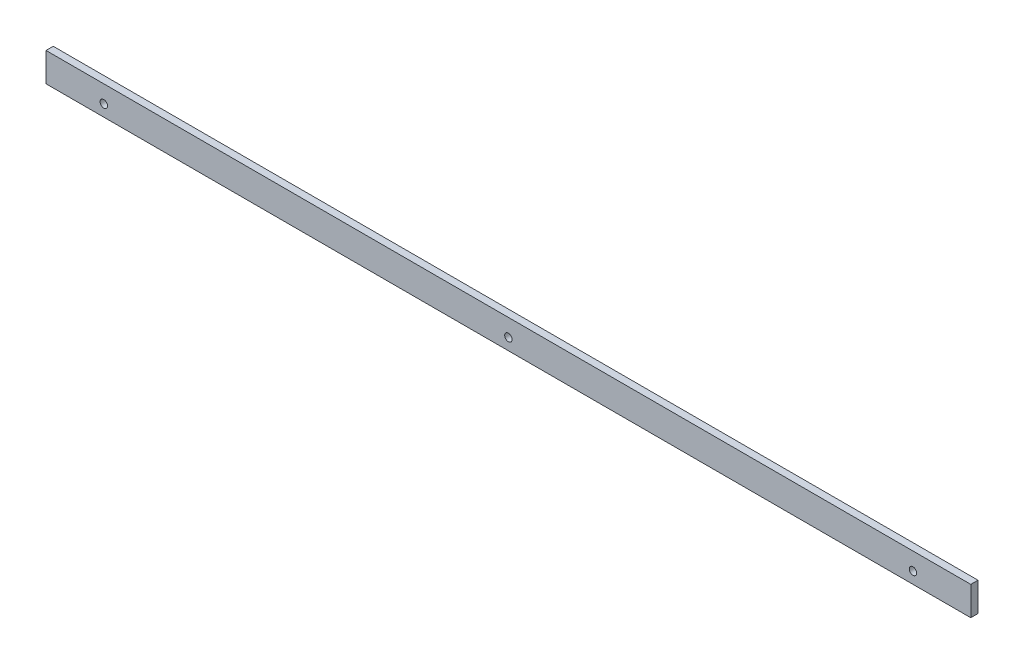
ISO-10303-21;
HEADER;
FILE_DESCRIPTION(('STEP AP214'),'2;1');
FILE_NAME('part.step','',(''),(''),'','','');
FILE_SCHEMA(('AUTOMOTIVE_DESIGN { 1 0 10303 214 1 1 1 1 }'));
ENDSEC;
DATA;
#1=APPLICATION_CONTEXT('core data for automotive mechanical design processes');
#2=APPLICATION_PROTOCOL_DEFINITION('international standard','automotive_design',2000,#1);
#3=PRODUCT_CONTEXT('',#1,'mechanical');
#4=PRODUCT('Part','Part','',(#3));
#5=PRODUCT_RELATED_PRODUCT_CATEGORY('part','',(#4));
#6=PRODUCT_DEFINITION_FORMATION('','',#4);
#7=PRODUCT_DEFINITION_CONTEXT('part definition',#1,'design');
#8=PRODUCT_DEFINITION('design','',#6,#7);
#9=PRODUCT_DEFINITION_SHAPE('','',#8);
#10=(LENGTH_UNIT() NAMED_UNIT(*) SI_UNIT(.MILLI.,.METRE.));
#11=(NAMED_UNIT(*) PLANE_ANGLE_UNIT() SI_UNIT($,.RADIAN.));
#12=(NAMED_UNIT(*) SI_UNIT($,.STERADIAN.) SOLID_ANGLE_UNIT());
#13=UNCERTAINTY_MEASURE_WITH_UNIT(LENGTH_MEASURE(1.E-05),#10,'distance_accuracy_value','');
#14=(GEOMETRIC_REPRESENTATION_CONTEXT(3) GLOBAL_UNCERTAINTY_ASSIGNED_CONTEXT((#13)) GLOBAL_UNIT_ASSIGNED_CONTEXT((#10,
#11,#12)) REPRESENTATION_CONTEXT('',''));
#15=CARTESIAN_POINT('',(0.,0.,0.));
#16=DIRECTION('',(0.,0.,1.));
#17=DIRECTION('',(1.,0.,0.));
#18=AXIS2_PLACEMENT_3D('',#15,#16,#17);
#19=CARTESIAN_POINT('',(-203.2,6.35,3.175));
#20=DIRECTION('',(1.,0.,0.));
#21=DIRECTION('',(0.,0.,-1.));
#22=AXIS2_PLACEMENT_3D('',#19,#20,#21);
#23=PLANE('',#22);
#24=DIRECTION('',(0.,-1.,0.));
#25=VECTOR('',#24,1.);
#26=CARTESIAN_POINT('',(-203.2,6.35,0.));
#27=LINE('',#26,#25);
#28=CARTESIAN_POINT('',(-203.2,6.35,0.));
#29=VERTEX_POINT('',#28);
#30=CARTESIAN_POINT('',(-203.2,-6.35,0.));
#31=VERTEX_POINT('',#30);
#32=EDGE_CURVE('E98',#29,#31,#27,.T.);
#33=ORIENTED_EDGE('',*,*,#32,.T.);
#34=DIRECTION('',(0.,0.,-1.));
#35=VECTOR('',#34,1.);
#36=CARTESIAN_POINT('',(-203.2,-6.35,3.175));
#37=LINE('',#36,#35);
#38=CARTESIAN_POINT('',(-203.2,-6.35,3.175));
#39=VERTEX_POINT('',#38);
#40=EDGE_CURVE('E11',#39,#31,#37,.T.);
#41=ORIENTED_EDGE('',*,*,#40,.F.);
#42=DIRECTION('',(0.,-1.,0.));
#43=VECTOR('',#42,1.);
#44=CARTESIAN_POINT('',(-203.2,6.35,3.175));
#45=LINE('',#44,#43);
#46=CARTESIAN_POINT('',(-203.2,6.35,3.175));
#47=VERTEX_POINT('',#46);
#48=EDGE_CURVE('E86',#47,#39,#45,.T.);
#49=ORIENTED_EDGE('',*,*,#48,.F.);
#50=DIRECTION('',(0.,0.,-1.));
#51=VECTOR('',#50,1.);
#52=CARTESIAN_POINT('',(-203.2,6.35,3.175));
#53=LINE('',#52,#51);
#54=EDGE_CURVE('E94',#47,#29,#53,.T.);
#55=ORIENTED_EDGE('',*,*,#54,.T.);
#56=EDGE_LOOP('',(#33,#41,#49,#55));
#57=FACE_BOUND('',#56,.T.);
#58=ADVANCED_FACE('F35',(#57),#23,.F.);
#59=CARTESIAN_POINT('',(-203.2,-6.35,3.175));
#60=DIRECTION('',(0.,1.,0.));
#61=DIRECTION('',(0.,0.,1.));
#62=AXIS2_PLACEMENT_3D('',#59,#60,#61);
#63=PLANE('',#62);
#64=DIRECTION('',(1.,0.,0.));
#65=VECTOR('',#64,1.);
#66=CARTESIAN_POINT('',(-203.2,-6.35,0.));
#67=LINE('',#66,#65);
#68=CARTESIAN_POINT('',(203.2,-6.35,0.));
#69=VERTEX_POINT('',#68);
#70=EDGE_CURVE('E90',#31,#69,#67,.T.);
#71=ORIENTED_EDGE('',*,*,#70,.T.);
#72=DIRECTION('',(0.,0.,-1.));
#73=VECTOR('',#72,1.);
#74=CARTESIAN_POINT('',(203.2,-6.35,3.175));
#75=LINE('',#74,#73);
#76=CARTESIAN_POINT('',(203.2,-6.35,3.175));
#77=VERTEX_POINT('',#76);
#78=EDGE_CURVE('E43',#77,#69,#75,.T.);
#79=ORIENTED_EDGE('',*,*,#78,.F.);
#80=DIRECTION('',(1.,0.,0.));
#81=VECTOR('',#80,1.);
#82=CARTESIAN_POINT('',(-203.2,-6.35,3.175));
#83=LINE('',#82,#81);
#84=EDGE_CURVE('E81',#39,#77,#83,.T.);
#85=ORIENTED_EDGE('',*,*,#84,.F.);
#86=ORIENTED_EDGE('',*,*,#40,.T.);
#87=EDGE_LOOP('',(#71,#79,#85,#86));
#88=FACE_BOUND('',#87,.T.);
#89=ADVANCED_FACE('F89',(#88),#63,.F.);
#90=CARTESIAN_POINT('',(203.2,6.35,3.175));
#91=DIRECTION('',(-1.,0.,0.));
#92=DIRECTION('',(0.,-1.,0.));
#93=AXIS2_PLACEMENT_3D('',#90,#91,#92);
#94=PLANE('',#93);
#95=DIRECTION('',(0.,1.,0.));
#96=VECTOR('',#95,1.);
#97=CARTESIAN_POINT('',(203.2,6.35,0.));
#98=LINE('',#97,#96);
#99=CARTESIAN_POINT('',(203.2,6.35,0.));
#100=VERTEX_POINT('',#99);
#101=EDGE_CURVE('E68',#69,#100,#98,.T.);
#102=ORIENTED_EDGE('',*,*,#101,.T.);
#103=DIRECTION('',(0.,0.,-1.));
#104=VECTOR('',#103,1.);
#105=CARTESIAN_POINT('',(203.2,6.35,3.175));
#106=LINE('',#105,#104);
#107=CARTESIAN_POINT('',(203.2,6.35,3.175));
#108=VERTEX_POINT('',#107);
#109=EDGE_CURVE('E91',#108,#100,#106,.T.);
#110=ORIENTED_EDGE('',*,*,#109,.F.);
#111=DIRECTION('',(0.,1.,0.));
#112=VECTOR('',#111,1.);
#113=CARTESIAN_POINT('',(203.2,6.35,3.175));
#114=LINE('',#113,#112);
#115=EDGE_CURVE('E84',#77,#108,#114,.T.);
#116=ORIENTED_EDGE('',*,*,#115,.F.);
#117=ORIENTED_EDGE('',*,*,#78,.T.);
#118=EDGE_LOOP('',(#102,#110,#116,#117));
#119=FACE_BOUND('',#118,.T.);
#120=ADVANCED_FACE('F92',(#119),#94,.F.);
#121=CARTESIAN_POINT('',(-203.2,6.35,3.175));
#122=DIRECTION('',(0.,-1.,0.));
#123=DIRECTION('',(0.,0.,-1.));
#124=AXIS2_PLACEMENT_3D('',#121,#122,#123);
#125=PLANE('',#124);
#126=DIRECTION('',(-1.,0.,0.));
#127=VECTOR('',#126,1.);
#128=CARTESIAN_POINT('',(-203.2,6.35,0.));
#129=LINE('',#128,#127);
#130=EDGE_CURVE('E74',#100,#29,#129,.T.);
#131=ORIENTED_EDGE('',*,*,#130,.T.);
#132=ORIENTED_EDGE('',*,*,#54,.F.);
#133=DIRECTION('',(-1.,0.,0.));
#134=VECTOR('',#133,1.);
#135=CARTESIAN_POINT('',(-203.2,6.35,3.175));
#136=LINE('',#135,#134);
#137=EDGE_CURVE('E51',#108,#47,#136,.T.);
#138=ORIENTED_EDGE('',*,*,#137,.F.);
#139=ORIENTED_EDGE('',*,*,#109,.T.);
#140=EDGE_LOOP('',(#131,#132,#138,#139));
#141=FACE_BOUND('',#140,.T.);
#142=ADVANCED_FACE('F106',(#141),#125,.F.);
#143=CARTESIAN_POINT('',(0.,0.,3.175));
#144=DIRECTION('',(0.,0.,1.));
#145=DIRECTION('',(1.,0.,0.));
#146=AXIS2_PLACEMENT_3D('',#143,#144,#145);
#147=PLANE('',#146);
#148=CARTESIAN_POINT('',(-177.8,-1.27,3.175));
#149=DIRECTION('',(0.,0.,1.));
#150=DIRECTION('',(1.,0.,0.));
#151=AXIS2_PLACEMENT_3D('',#148,#149,#150);
#152=CIRCLE('',#151,1.63194999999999);
#153=CARTESIAN_POINT('',(-176.16805,-1.27,3.175));
#154=VERTEX_POINT('',#153);
#155=EDGE_CURVE('E126',#154,#154,#152,.T.);
#156=ORIENTED_EDGE('',*,*,#155,.F.);
#157=EDGE_LOOP('',(#156));
#158=FACE_BOUND('',#157,.T.);
#159=CARTESIAN_POINT('',(0.,-1.27,3.175));
#160=DIRECTION('',(0.,0.,1.));
#161=DIRECTION('',(1.,0.,0.));
#162=AXIS2_PLACEMENT_3D('',#159,#160,#161);
#163=CIRCLE('',#162,1.63195);
#164=CARTESIAN_POINT('',(1.63195,-1.27,3.175));
#165=VERTEX_POINT('',#164);
#166=EDGE_CURVE('E120',#165,#165,#163,.T.);
#167=ORIENTED_EDGE('',*,*,#166,.F.);
#168=EDGE_LOOP('',(#167));
#169=FACE_BOUND('',#168,.T.);
#170=CARTESIAN_POINT('',(177.8,-1.27,3.175));
#171=DIRECTION('',(0.,0.,1.));
#172=DIRECTION('',(1.,0.,0.));
#173=AXIS2_PLACEMENT_3D('',#170,#171,#172);
#174=CIRCLE('',#173,1.63194999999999);
#175=CARTESIAN_POINT('',(179.43195,-1.27,3.175));
#176=VERTEX_POINT('',#175);
#177=EDGE_CURVE('E114',#176,#176,#174,.T.);
#178=ORIENTED_EDGE('',*,*,#177,.F.);
#179=EDGE_LOOP('',(#178));
#180=FACE_BOUND('',#179,.T.);
#181=ORIENTED_EDGE('',*,*,#48,.T.);
#182=ORIENTED_EDGE('',*,*,#84,.T.);
#183=ORIENTED_EDGE('',*,*,#115,.T.);
#184=ORIENTED_EDGE('',*,*,#137,.T.);
#185=EDGE_LOOP('',(#181,#182,#183,#184));
#186=FACE_BOUND('',#185,.T.);
#187=ADVANCED_FACE('F82',(#158,#169,#180,#186),#147,.T.);
#188=CARTESIAN_POINT('',(0.,0.,0.));
#189=DIRECTION('',(0.,0.,1.));
#190=DIRECTION('',(1.,0.,0.));
#191=AXIS2_PLACEMENT_3D('',#188,#189,#190);
#192=PLANE('',#191);
#193=CARTESIAN_POINT('',(-177.8,-1.27,0.));
#194=DIRECTION('',(0.,0.,1.));
#195=DIRECTION('',(1.,0.,0.));
#196=AXIS2_PLACEMENT_3D('',#193,#194,#195);
#197=CIRCLE('',#196,1.63194999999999);
#198=CARTESIAN_POINT('',(-176.16805,-1.27,0.));
#199=VERTEX_POINT('',#198);
#200=EDGE_CURVE('E123',#199,#199,#197,.T.);
#201=ORIENTED_EDGE('',*,*,#200,.T.);
#202=EDGE_LOOP('',(#201));
#203=FACE_BOUND('',#202,.T.);
#204=CARTESIAN_POINT('',(0.,-1.27,0.));
#205=DIRECTION('',(0.,0.,1.));
#206=DIRECTION('',(1.,0.,0.));
#207=AXIS2_PLACEMENT_3D('',#204,#205,#206);
#208=CIRCLE('',#207,1.63195);
#209=CARTESIAN_POINT('',(1.63195,-1.27,0.));
#210=VERTEX_POINT('',#209);
#211=EDGE_CURVE('E117',#210,#210,#208,.T.);
#212=ORIENTED_EDGE('',*,*,#211,.T.);
#213=EDGE_LOOP('',(#212));
#214=FACE_BOUND('',#213,.T.);
#215=CARTESIAN_POINT('',(177.8,-1.27,0.));
#216=DIRECTION('',(0.,0.,1.));
#217=DIRECTION('',(1.,0.,0.));
#218=AXIS2_PLACEMENT_3D('',#215,#216,#217);
#219=CIRCLE('',#218,1.63194999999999);
#220=CARTESIAN_POINT('',(179.43195,-1.27,0.));
#221=VERTEX_POINT('',#220);
#222=EDGE_CURVE('E101',#221,#221,#219,.T.);
#223=ORIENTED_EDGE('',*,*,#222,.T.);
#224=EDGE_LOOP('',(#223));
#225=FACE_BOUND('',#224,.T.);
#226=ORIENTED_EDGE('',*,*,#32,.F.);
#227=ORIENTED_EDGE('',*,*,#130,.F.);
#228=ORIENTED_EDGE('',*,*,#101,.F.);
#229=ORIENTED_EDGE('',*,*,#70,.F.);
#230=EDGE_LOOP('',(#226,#227,#228,#229));
#231=FACE_BOUND('',#230,.T.);
#232=ADVANCED_FACE('F109',(#203,#214,#225,#231),#192,.F.);
#233=CARTESIAN_POINT('',(177.8,-1.27,3.175));
#234=DIRECTION('',(0.,0.,1.));
#235=DIRECTION('',(1.,0.,0.));
#236=AXIS2_PLACEMENT_3D('',#233,#234,#235);
#237=CYLINDRICAL_SURFACE('',#236,1.63194999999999);
#238=ORIENTED_EDGE('',*,*,#222,.F.);
#239=EDGE_LOOP('',(#238));
#240=FACE_BOUND('',#239,.T.);
#241=ORIENTED_EDGE('',*,*,#177,.T.);
#242=EDGE_LOOP('',(#241));
#243=FACE_BOUND('',#242,.T.);
#244=ADVANCED_FACE('F139',(#240,#243),#237,.F.);
#245=CARTESIAN_POINT('',(0.,-1.27,3.175));
#246=DIRECTION('',(0.,0.,1.));
#247=DIRECTION('',(1.,0.,0.));
#248=AXIS2_PLACEMENT_3D('',#245,#246,#247);
#249=CYLINDRICAL_SURFACE('',#248,1.63195);
#250=ORIENTED_EDGE('',*,*,#211,.F.);
#251=EDGE_LOOP('',(#250));
#252=FACE_BOUND('',#251,.T.);
#253=ORIENTED_EDGE('',*,*,#166,.T.);
#254=EDGE_LOOP('',(#253));
#255=FACE_BOUND('',#254,.T.);
#256=ADVANCED_FACE('F141',(#252,#255),#249,.F.);
#257=CARTESIAN_POINT('',(-177.8,-1.27,3.175));
#258=DIRECTION('',(0.,0.,1.));
#259=DIRECTION('',(1.,0.,0.));
#260=AXIS2_PLACEMENT_3D('',#257,#258,#259);
#261=CYLINDRICAL_SURFACE('',#260,1.63194999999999);
#262=ORIENTED_EDGE('',*,*,#200,.F.);
#263=EDGE_LOOP('',(#262));
#264=FACE_BOUND('',#263,.T.);
#265=ORIENTED_EDGE('',*,*,#155,.T.);
#266=EDGE_LOOP('',(#265));
#267=FACE_BOUND('',#266,.T.);
#268=ADVANCED_FACE('F130',(#264,#267),#261,.F.);
#269=CLOSED_SHELL('',(#58,#89,#120,#142,#187,#232,#244,#256,#268));
#270=MANIFOLD_SOLID_BREP('B2',#269);
#271=ADVANCED_BREP_SHAPE_REPRESENTATION('',(#18,#270),#14);
#272=SHAPE_DEFINITION_REPRESENTATION(#9,#271);
ENDSEC;
END-ISO-10303-21;
